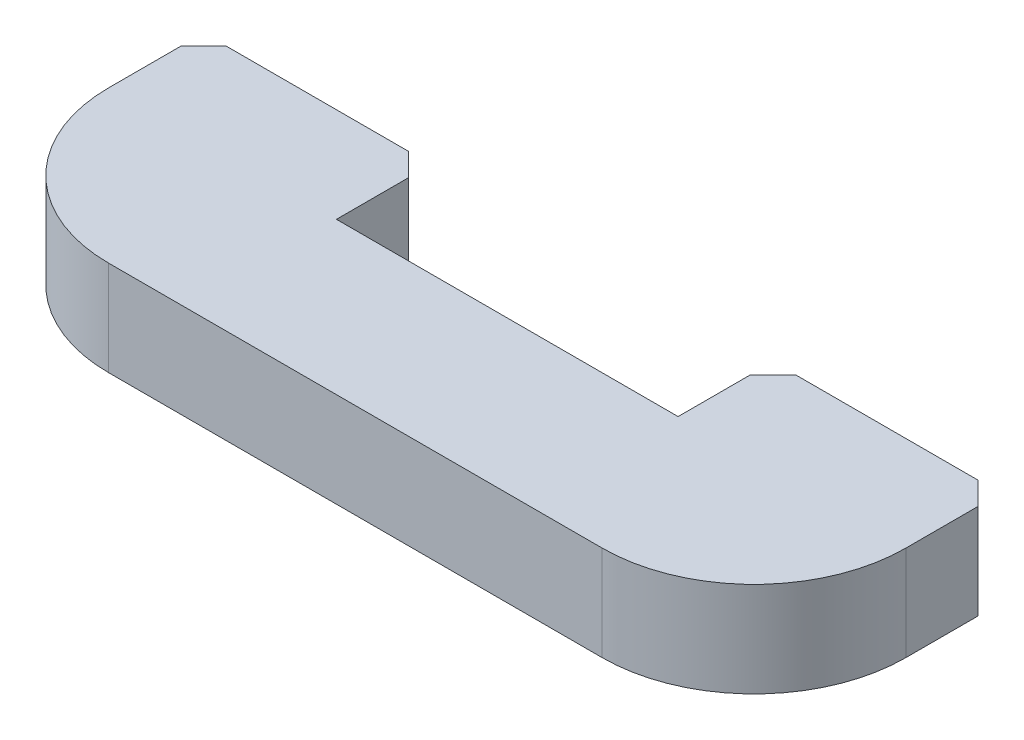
ISO-10303-21;
HEADER;
FILE_DESCRIPTION(('STEP AP214'),'2;1');
FILE_NAME('part.step','',(''),(''),'','','');
FILE_SCHEMA(('AUTOMOTIVE_DESIGN { 1 0 10303 214 1 1 1 1 }'));
ENDSEC;
DATA;
#1=APPLICATION_CONTEXT('core data for automotive mechanical design processes');
#2=APPLICATION_PROTOCOL_DEFINITION('international standard','automotive_design',2000,#1);
#3=PRODUCT_CONTEXT('',#1,'mechanical');
#4=PRODUCT('Part','Part','',(#3));
#5=PRODUCT_RELATED_PRODUCT_CATEGORY('part','',(#4));
#6=PRODUCT_DEFINITION_FORMATION('','',#4);
#7=PRODUCT_DEFINITION_CONTEXT('part definition',#1,'design');
#8=PRODUCT_DEFINITION('design','',#6,#7);
#9=PRODUCT_DEFINITION_SHAPE('','',#8);
#10=(LENGTH_UNIT() NAMED_UNIT(*) SI_UNIT(.MILLI.,.METRE.));
#11=(NAMED_UNIT(*) PLANE_ANGLE_UNIT() SI_UNIT($,.RADIAN.));
#12=(NAMED_UNIT(*) SI_UNIT($,.STERADIAN.) SOLID_ANGLE_UNIT());
#13=UNCERTAINTY_MEASURE_WITH_UNIT(LENGTH_MEASURE(1.E-05),#10,'distance_accuracy_value','');
#14=(GEOMETRIC_REPRESENTATION_CONTEXT(3) GLOBAL_UNCERTAINTY_ASSIGNED_CONTEXT((#13)) GLOBAL_UNIT_ASSIGNED_CONTEXT((#10,
#11,#12)) REPRESENTATION_CONTEXT('',''));
#15=CARTESIAN_POINT('',(0.,0.,0.));
#16=DIRECTION('',(0.,0.,1.));
#17=DIRECTION('',(1.,0.,0.));
#18=AXIS2_PLACEMENT_3D('',#15,#16,#17);
#19=CARTESIAN_POINT('',(-13.335,3.175,-4.1275));
#20=DIRECTION('',(0.,0.,1.));
#21=DIRECTION('',(1.,0.,0.));
#22=AXIS2_PLACEMENT_3D('',#19,#20,#21);
#23=PLANE('',#22);
#24=DIRECTION('',(-1.,0.,0.));
#25=VECTOR('',#24,1.);
#26=CARTESIAN_POINT('',(-13.335,3.175,-4.1275));
#27=LINE('',#26,#25);
#28=CARTESIAN_POINT('',(12.573,3.175,-4.1275));
#29=VERTEX_POINT('',#28);
#30=CARTESIAN_POINT('',(6.477,3.175,-4.1275));
#31=VERTEX_POINT('',#30);
#32=EDGE_CURVE('E197',#29,#31,#27,.T.);
#33=ORIENTED_EDGE('',*,*,#32,.F.);
#34=DIRECTION('',(0.,-1.,0.));
#35=VECTOR('',#34,1.);
#36=CARTESIAN_POINT('',(12.573,3.175,-4.1275));
#37=LINE('',#36,#35);
#38=CARTESIAN_POINT('',(12.573,0.,-4.1275));
#39=VERTEX_POINT('',#38);
#40=EDGE_CURVE('E222',#29,#39,#37,.T.);
#41=ORIENTED_EDGE('',*,*,#40,.T.);
#42=DIRECTION('',(-1.,0.,0.));
#43=VECTOR('',#42,1.);
#44=CARTESIAN_POINT('',(-13.335,0.,-4.1275));
#45=LINE('',#44,#43);
#46=CARTESIAN_POINT('',(6.477,0.,-4.1275));
#47=VERTEX_POINT('',#46);
#48=EDGE_CURVE('E210',#39,#47,#45,.T.);
#49=ORIENTED_EDGE('',*,*,#48,.T.);
#50=DIRECTION('',(0.,1.,0.));
#51=VECTOR('',#50,1.);
#52=CARTESIAN_POINT('',(6.477,3.175,-4.1275));
#53=LINE('',#52,#51);
#54=EDGE_CURVE('E218',#47,#31,#53,.T.);
#55=ORIENTED_EDGE('',*,*,#54,.T.);
#56=EDGE_LOOP('',(#33,#41,#49,#55));
#57=FACE_BOUND('',#56,.T.);
#58=ADVANCED_FACE('F43',(#57),#23,.F.);
#59=CARTESIAN_POINT('',(13.335,3.175,-4.1275));
#60=DIRECTION('',(-1.,0.,0.));
#61=DIRECTION('',(0.,0.,1.));
#62=AXIS2_PLACEMENT_3D('',#59,#60,#61);
#63=PLANE('',#62);
#64=DIRECTION('',(0.,0.,-1.));
#65=VECTOR('',#64,1.);
#66=CARTESIAN_POINT('',(13.335,3.175,-4.1275));
#67=LINE('',#66,#65);
#68=CARTESIAN_POINT('',(13.335,3.175,-0.952500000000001));
#69=VERTEX_POINT('',#68);
#70=CARTESIAN_POINT('',(13.335,3.175,-3.3655));
#71=VERTEX_POINT('',#70);
#72=EDGE_CURVE('E189',#69,#71,#67,.T.);
#73=ORIENTED_EDGE('',*,*,#72,.F.);
#74=DIRECTION('',(0.,-1.,0.));
#75=VECTOR('',#74,1.);
#76=CARTESIAN_POINT('',(13.335,3.175,-0.952500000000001));
#77=LINE('',#76,#75);
#78=CARTESIAN_POINT('',(13.335,0.,-0.952500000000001));
#79=VERTEX_POINT('',#78);
#80=EDGE_CURVE('E271',#69,#79,#77,.T.);
#81=ORIENTED_EDGE('',*,*,#80,.T.);
#82=DIRECTION('',(0.,0.,-1.));
#83=VECTOR('',#82,1.);
#84=CARTESIAN_POINT('',(13.335,0.,-4.1275));
#85=LINE('',#84,#83);
#86=CARTESIAN_POINT('',(13.335,0.,-3.3655));
#87=VERTEX_POINT('',#86);
#88=EDGE_CURVE('E160',#79,#87,#85,.T.);
#89=ORIENTED_EDGE('',*,*,#88,.T.);
#90=DIRECTION('',(0.,1.,0.));
#91=VECTOR('',#90,1.);
#92=CARTESIAN_POINT('',(13.335,3.175,-3.3655));
#93=LINE('',#92,#91);
#94=EDGE_CURVE('E239',#87,#71,#93,.T.);
#95=ORIENTED_EDGE('',*,*,#94,.T.);
#96=EDGE_LOOP('',(#73,#81,#89,#95));
#97=FACE_BOUND('',#96,.T.);
#98=ADVANCED_FACE('F297',(#97),#63,.F.);
#99=CARTESIAN_POINT('',(-6.477,0.,-4.1275));
#100=VERTEX_POINT('',#99);
#101=CARTESIAN_POINT('',(-12.573,0.,-4.1275));
#102=VERTEX_POINT('',#101);
#103=EDGE_CURVE('E206',#100,#102,#45,.T.);
#104=ORIENTED_EDGE('',*,*,#103,.T.);
#105=DIRECTION('',(0.,1.,0.));
#106=VECTOR('',#105,1.);
#107=CARTESIAN_POINT('',(-12.573,3.175,-4.1275));
#108=LINE('',#107,#106);
#109=CARTESIAN_POINT('',(-12.573,3.175,-4.1275));
#110=VERTEX_POINT('',#109);
#111=EDGE_CURVE('E265',#102,#110,#108,.T.);
#112=ORIENTED_EDGE('',*,*,#111,.T.);
#113=CARTESIAN_POINT('',(-6.477,3.175,-4.1275));
#114=VERTEX_POINT('',#113);
#115=EDGE_CURVE('E192',#114,#110,#27,.T.);
#116=ORIENTED_EDGE('',*,*,#115,.F.);
#117=DIRECTION('',(0.,-1.,0.));
#118=VECTOR('',#117,1.);
#119=CARTESIAN_POINT('',(-6.477,3.175,-4.1275));
#120=LINE('',#119,#118);
#121=EDGE_CURVE('E261',#114,#100,#120,.T.);
#122=ORIENTED_EDGE('',*,*,#121,.T.);
#123=EDGE_LOOP('',(#104,#112,#116,#122));
#124=FACE_BOUND('',#123,.T.);
#125=ADVANCED_FACE('F315',(#124),#23,.F.);
#126=CARTESIAN_POINT('',(-13.335,3.175,-4.1275));
#127=DIRECTION('',(1.,0.,0.));
#128=DIRECTION('',(0.,0.,-1.));
#129=AXIS2_PLACEMENT_3D('',#126,#127,#128);
#130=PLANE('',#129);
#131=DIRECTION('',(0.,0.,1.));
#132=VECTOR('',#131,1.);
#133=CARTESIAN_POINT('',(-13.335,0.,-4.1275));
#134=LINE('',#133,#132);
#135=CARTESIAN_POINT('',(-13.335,0.,-3.3655));
#136=VERTEX_POINT('',#135);
#137=CARTESIAN_POINT('',(-13.335,0.,-0.952499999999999));
#138=VERTEX_POINT('',#137);
#139=EDGE_CURVE('E211',#136,#138,#134,.T.);
#140=ORIENTED_EDGE('',*,*,#139,.T.);
#141=DIRECTION('',(0.,-1.,0.));
#142=VECTOR('',#141,1.);
#143=CARTESIAN_POINT('',(-13.335,3.175,-0.952499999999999));
#144=LINE('',#143,#142);
#145=CARTESIAN_POINT('',(-13.335,3.175,-0.952499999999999));
#146=VERTEX_POINT('',#145);
#147=EDGE_CURVE('E11',#138,#146,#144,.F.);
#148=ORIENTED_EDGE('',*,*,#147,.T.);
#149=DIRECTION('',(0.,0.,1.));
#150=VECTOR('',#149,1.);
#151=CARTESIAN_POINT('',(-13.335,3.175,-4.1275));
#152=LINE('',#151,#150);
#153=CARTESIAN_POINT('',(-13.335,3.175,-3.3655));
#154=VERTEX_POINT('',#153);
#155=EDGE_CURVE('E198',#154,#146,#152,.T.);
#156=ORIENTED_EDGE('',*,*,#155,.F.);
#157=DIRECTION('',(0.,-1.,0.));
#158=VECTOR('',#157,1.);
#159=CARTESIAN_POINT('',(-13.335,3.175,-3.3655));
#160=LINE('',#159,#158);
#161=EDGE_CURVE('E257',#154,#136,#160,.T.);
#162=ORIENTED_EDGE('',*,*,#161,.T.);
#163=EDGE_LOOP('',(#140,#148,#156,#162));
#164=FACE_BOUND('',#163,.T.);
#165=ADVANCED_FACE('F307',(#164),#130,.F.);
#166=CARTESIAN_POINT('',(-13.335,3.175,4.1275));
#167=DIRECTION('',(0.,0.,-1.));
#168=DIRECTION('',(-1.,0.,0.));
#169=AXIS2_PLACEMENT_3D('',#166,#167,#168);
#170=PLANE('',#169);
#171=DIRECTION('',(1.,0.,0.));
#172=VECTOR('',#171,1.);
#173=CARTESIAN_POINT('',(-13.335,0.,4.1275));
#174=LINE('',#173,#172);
#175=CARTESIAN_POINT('',(-8.255,0.,4.1275));
#176=VERTEX_POINT('',#175);
#177=CARTESIAN_POINT('',(8.255,0.,4.1275));
#178=VERTEX_POINT('',#177);
#179=EDGE_CURVE('E193',#176,#178,#174,.T.);
#180=ORIENTED_EDGE('',*,*,#179,.T.);
#181=DIRECTION('',(0.,-1.,0.));
#182=VECTOR('',#181,1.);
#183=CARTESIAN_POINT('',(8.255,3.175,4.1275));
#184=LINE('',#183,#182);
#185=CARTESIAN_POINT('',(8.255,3.175,4.1275));
#186=VERTEX_POINT('',#185);
#187=EDGE_CURVE('E65',#178,#186,#184,.F.);
#188=ORIENTED_EDGE('',*,*,#187,.T.);
#189=DIRECTION('',(1.,0.,0.));
#190=VECTOR('',#189,1.);
#191=CARTESIAN_POINT('',(-13.335,3.175,4.1275));
#192=LINE('',#191,#190);
#193=CARTESIAN_POINT('',(-8.255,3.175,4.1275));
#194=VERTEX_POINT('',#193);
#195=EDGE_CURVE('E201',#194,#186,#192,.T.);
#196=ORIENTED_EDGE('',*,*,#195,.F.);
#197=DIRECTION('',(0.,-1.,0.));
#198=VECTOR('',#197,1.);
#199=CARTESIAN_POINT('',(-8.255,3.175,4.1275));
#200=LINE('',#199,#198);
#201=EDGE_CURVE('E281',#194,#176,#200,.T.);
#202=ORIENTED_EDGE('',*,*,#201,.T.);
#203=EDGE_LOOP('',(#180,#188,#196,#202));
#204=FACE_BOUND('',#203,.T.);
#205=ADVANCED_FACE('F302',(#204),#170,.F.);
#206=CARTESIAN_POINT('',(0.,3.175,0.));
#207=DIRECTION('',(0.,1.,0.));
#208=DIRECTION('',(0.,0.,1.));
#209=AXIS2_PLACEMENT_3D('',#206,#207,#208);
#210=PLANE('',#209);
#211=ORIENTED_EDGE('',*,*,#195,.T.);
#212=CARTESIAN_POINT('',(8.255,3.175,-0.9525));
#213=DIRECTION('',(0.,1.,0.));
#214=DIRECTION('',(0.,0.,1.));
#215=AXIS2_PLACEMENT_3D('',#212,#213,#214);
#216=CIRCLE('',#215,5.08);
#217=EDGE_CURVE('E52',#186,#69,#216,.T.);
#218=ORIENTED_EDGE('',*,*,#217,.T.);
#219=ORIENTED_EDGE('',*,*,#72,.T.);
#220=DIRECTION('',(0.707106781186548,0.,0.707106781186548));
#221=VECTOR('',#220,1.);
#222=CARTESIAN_POINT('',(8.35025,3.175,-8.35025));
#223=LINE('',#222,#221);
#224=EDGE_CURVE('E252',#71,#29,#223,.F.);
#225=ORIENTED_EDGE('',*,*,#224,.T.);
#226=ORIENTED_EDGE('',*,*,#32,.T.);
#227=DIRECTION('',(0.707106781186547,0.,-0.707106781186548));
#228=VECTOR('',#227,1.);
#229=CARTESIAN_POINT('',(1.17475000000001,3.175,1.17475));
#230=LINE('',#229,#228);
#231=CARTESIAN_POINT('',(5.715,3.175,-3.3655));
#232=VERTEX_POINT('',#231);
#233=EDGE_CURVE('E249',#31,#232,#230,.F.);
#234=ORIENTED_EDGE('',*,*,#233,.T.);
#235=DIRECTION('',(0.,0.,-1.));
#236=VECTOR('',#235,1.);
#237=CARTESIAN_POINT('',(5.715,3.175,-7.3025));
#238=LINE('',#237,#236);
#239=CARTESIAN_POINT('',(5.715,3.175,-0.952500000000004));
#240=VERTEX_POINT('',#239);
#241=EDGE_CURVE('E181',#240,#232,#238,.T.);
#242=ORIENTED_EDGE('',*,*,#241,.F.);
#243=DIRECTION('',(1.,0.,0.));
#244=VECTOR('',#243,1.);
#245=CARTESIAN_POINT('',(-5.715,3.175,-0.952500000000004));
#246=LINE('',#245,#244);
#247=CARTESIAN_POINT('',(-5.715,3.175,-0.952500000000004));
#248=VERTEX_POINT('',#247);
#249=EDGE_CURVE('E155',#248,#240,#246,.T.);
#250=ORIENTED_EDGE('',*,*,#249,.F.);
#251=DIRECTION('',(0.,0.,1.));
#252=VECTOR('',#251,1.);
#253=CARTESIAN_POINT('',(-5.715,3.175,-7.3025));
#254=LINE('',#253,#252);
#255=CARTESIAN_POINT('',(-5.715,3.175,-3.3655));
#256=VERTEX_POINT('',#255);
#257=EDGE_CURVE('E184',#256,#248,#254,.T.);
#258=ORIENTED_EDGE('',*,*,#257,.F.);
#259=DIRECTION('',(0.707106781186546,0.,0.70710678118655));
#260=VECTOR('',#259,1.);
#261=CARTESIAN_POINT('',(-1.17475000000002,3.175,1.17475000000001));
#262=LINE('',#261,#260);
#263=EDGE_CURVE('E243',#256,#114,#262,.F.);
#264=ORIENTED_EDGE('',*,*,#263,.T.);
#265=ORIENTED_EDGE('',*,*,#115,.T.);
#266=DIRECTION('',(0.707106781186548,0.,-0.707106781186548));
#267=VECTOR('',#266,1.);
#268=CARTESIAN_POINT('',(-8.35025,3.175,-8.35025));
#269=LINE('',#268,#267);
#270=EDGE_CURVE('E246',#110,#154,#269,.F.);
#271=ORIENTED_EDGE('',*,*,#270,.T.);
#272=ORIENTED_EDGE('',*,*,#155,.T.);
#273=CARTESIAN_POINT('',(-8.255,3.175,-0.9525));
#274=DIRECTION('',(0.,1.,0.));
#275=DIRECTION('',(0.,0.,1.));
#276=AXIS2_PLACEMENT_3D('',#273,#274,#275);
#277=CIRCLE('',#276,5.08);
#278=EDGE_CURVE('E287',#146,#194,#277,.T.);
#279=ORIENTED_EDGE('',*,*,#278,.T.);
#280=EDGE_LOOP('',(#211,#218,#219,#225,#226,#234,#242,#250,#258,#264,#265,#271,#272,#279));
#281=FACE_BOUND('',#280,.T.);
#282=ADVANCED_FACE('F293',(#281),#210,.T.);
#283=CARTESIAN_POINT('',(0.,0.,0.));
#284=DIRECTION('',(0.,1.,0.));
#285=DIRECTION('',(0.,0.,1.));
#286=AXIS2_PLACEMENT_3D('',#283,#284,#285);
#287=PLANE('',#286);
#288=ORIENTED_EDGE('',*,*,#88,.F.);
#289=CARTESIAN_POINT('',(8.255,0.,-0.9525));
#290=DIRECTION('',(0.,1.,0.));
#291=DIRECTION('',(0.,0.,1.));
#292=AXIS2_PLACEMENT_3D('',#289,#290,#291);
#293=CIRCLE('',#292,5.08);
#294=EDGE_CURVE('E278',#79,#178,#293,.F.);
#295=ORIENTED_EDGE('',*,*,#294,.T.);
#296=ORIENTED_EDGE('',*,*,#179,.F.);
#297=CARTESIAN_POINT('',(-8.255,0.,-0.9525));
#298=DIRECTION('',(0.,1.,0.));
#299=DIRECTION('',(0.,0.,1.));
#300=AXIS2_PLACEMENT_3D('',#297,#298,#299);
#301=CIRCLE('',#300,5.08);
#302=EDGE_CURVE('E275',#176,#138,#301,.F.);
#303=ORIENTED_EDGE('',*,*,#302,.T.);
#304=ORIENTED_EDGE('',*,*,#139,.F.);
#305=DIRECTION('',(-0.707106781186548,0.,0.707106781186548));
#306=VECTOR('',#305,1.);
#307=CARTESIAN_POINT('',(-13.335,0.,-3.3655));
#308=LINE('',#307,#306);
#309=EDGE_CURVE('E229',#136,#102,#308,.F.);
#310=ORIENTED_EDGE('',*,*,#309,.T.);
#311=ORIENTED_EDGE('',*,*,#103,.F.);
#312=DIRECTION('',(-0.707106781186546,0.,-0.70710678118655));
#313=VECTOR('',#312,1.);
#314=CARTESIAN_POINT('',(-6.477,0.,-4.1275));
#315=LINE('',#314,#313);
#316=CARTESIAN_POINT('',(-5.715,0.,-3.3655));
#317=VERTEX_POINT('',#316);
#318=EDGE_CURVE('E226',#100,#317,#315,.F.);
#319=ORIENTED_EDGE('',*,*,#318,.T.);
#320=DIRECTION('',(0.,0.,1.));
#321=VECTOR('',#320,1.);
#322=CARTESIAN_POINT('',(-5.715,0.,0.));
#323=LINE('',#322,#321);
#324=CARTESIAN_POINT('',(-5.715,0.,-0.952500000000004));
#325=VERTEX_POINT('',#324);
#326=EDGE_CURVE('E175',#317,#325,#323,.T.);
#327=ORIENTED_EDGE('',*,*,#326,.T.);
#328=DIRECTION('',(1.,0.,0.));
#329=VECTOR('',#328,1.);
#330=CARTESIAN_POINT('',(-5.715,0.,-0.952500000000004));
#331=LINE('',#330,#329);
#332=CARTESIAN_POINT('',(5.715,0.,-0.952500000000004));
#333=VERTEX_POINT('',#332);
#334=EDGE_CURVE('E152',#325,#333,#331,.T.);
#335=ORIENTED_EDGE('',*,*,#334,.T.);
#336=DIRECTION('',(0.,0.,-1.));
#337=VECTOR('',#336,1.);
#338=CARTESIAN_POINT('',(5.715,0.,-7.3025));
#339=LINE('',#338,#337);
#340=CARTESIAN_POINT('',(5.715,0.,-3.3655));
#341=VERTEX_POINT('',#340);
#342=EDGE_CURVE('E164',#333,#341,#339,.T.);
#343=ORIENTED_EDGE('',*,*,#342,.T.);
#344=DIRECTION('',(-0.707106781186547,0.,0.707106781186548));
#345=VECTOR('',#344,1.);
#346=CARTESIAN_POINT('',(6.477,0.,-4.1275));
#347=LINE('',#346,#345);
#348=EDGE_CURVE('E232',#341,#47,#347,.F.);
#349=ORIENTED_EDGE('',*,*,#348,.T.);
#350=ORIENTED_EDGE('',*,*,#48,.F.);
#351=DIRECTION('',(-0.707106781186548,0.,-0.707106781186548));
#352=VECTOR('',#351,1.);
#353=CARTESIAN_POINT('',(12.573,0.,-4.1275));
#354=LINE('',#353,#352);
#355=EDGE_CURVE('E235',#39,#87,#354,.F.);
#356=ORIENTED_EDGE('',*,*,#355,.T.);
#357=EDGE_LOOP('',(#288,#295,#296,#303,#304,#310,#311,#319,#327,#335,#343,#349,#350,#356));
#358=FACE_BOUND('',#357,.T.);
#359=ADVANCED_FACE('F173',(#358),#287,.F.);
#360=CARTESIAN_POINT('',(5.715,0.,-7.3025));
#361=DIRECTION('',(1.,0.,0.));
#362=DIRECTION('',(0.,0.,-1.));
#363=AXIS2_PLACEMENT_3D('',#360,#361,#362);
#364=PLANE('',#363);
#365=ORIENTED_EDGE('',*,*,#241,.T.);
#366=DIRECTION('',(0.,-1.,0.));
#367=VECTOR('',#366,1.);
#368=CARTESIAN_POINT('',(5.715,0.,-3.3655));
#369=LINE('',#368,#367);
#370=EDGE_CURVE('E167',#232,#341,#369,.T.);
#371=ORIENTED_EDGE('',*,*,#370,.T.);
#372=ORIENTED_EDGE('',*,*,#342,.F.);
#373=DIRECTION('',(0.,1.,0.));
#374=VECTOR('',#373,1.);
#375=CARTESIAN_POINT('',(5.715,0.,-0.952500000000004));
#376=LINE('',#375,#374);
#377=EDGE_CURVE('E147',#333,#240,#376,.T.);
#378=ORIENTED_EDGE('',*,*,#377,.T.);
#379=EDGE_LOOP('',(#365,#371,#372,#378));
#380=FACE_BOUND('',#379,.T.);
#381=ADVANCED_FACE('F165',(#380),#364,.F.);
#382=CARTESIAN_POINT('',(-5.715,0.,-7.3025));
#383=DIRECTION('',(-1.,0.,0.));
#384=DIRECTION('',(0.,0.,1.));
#385=AXIS2_PLACEMENT_3D('',#382,#383,#384);
#386=PLANE('',#385);
#387=ORIENTED_EDGE('',*,*,#326,.F.);
#388=DIRECTION('',(0.,1.,0.));
#389=VECTOR('',#388,1.);
#390=CARTESIAN_POINT('',(-5.715,0.,-3.3655));
#391=LINE('',#390,#389);
#392=EDGE_CURVE('E268',#317,#256,#391,.T.);
#393=ORIENTED_EDGE('',*,*,#392,.T.);
#394=ORIENTED_EDGE('',*,*,#257,.T.);
#395=DIRECTION('',(0.,1.,0.));
#396=VECTOR('',#395,1.);
#397=CARTESIAN_POINT('',(-5.715,0.,-0.952500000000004));
#398=LINE('',#397,#396);
#399=EDGE_CURVE('E161',#325,#248,#398,.T.);
#400=ORIENTED_EDGE('',*,*,#399,.F.);
#401=EDGE_LOOP('',(#387,#393,#394,#400));
#402=FACE_BOUND('',#401,.T.);
#403=ADVANCED_FACE('F323',(#402),#386,.F.);
#404=CARTESIAN_POINT('',(-5.715,0.,-0.952500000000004));
#405=DIRECTION('',(0.,0.,1.));
#406=DIRECTION('',(1.,0.,0.));
#407=AXIS2_PLACEMENT_3D('',#404,#405,#406);
#408=PLANE('',#407);
#409=ORIENTED_EDGE('',*,*,#249,.T.);
#410=ORIENTED_EDGE('',*,*,#377,.F.);
#411=ORIENTED_EDGE('',*,*,#334,.F.);
#412=ORIENTED_EDGE('',*,*,#399,.T.);
#413=EDGE_LOOP('',(#409,#410,#411,#412));
#414=FACE_BOUND('',#413,.T.);
#415=ADVANCED_FACE('F149',(#414),#408,.F.);
#416=CARTESIAN_POINT('',(12.573,3.175,-4.1275));
#417=DIRECTION('',(-0.707106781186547,0.,0.707106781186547));
#418=DIRECTION('',(0.,-1.,0.));
#419=AXIS2_PLACEMENT_3D('',#416,#417,#418);
#420=PLANE('',#419);
#421=ORIENTED_EDGE('',*,*,#224,.F.);
#422=ORIENTED_EDGE('',*,*,#94,.F.);
#423=ORIENTED_EDGE('',*,*,#355,.F.);
#424=ORIENTED_EDGE('',*,*,#40,.F.);
#425=EDGE_LOOP('',(#421,#422,#423,#424));
#426=FACE_BOUND('',#425,.T.);
#427=ADVANCED_FACE('F337',(#426),#420,.F.);
#428=CARTESIAN_POINT('',(6.477,3.175,-4.1275));
#429=DIRECTION('',(0.707106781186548,0.,0.707106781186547));
#430=DIRECTION('',(0.,1.,0.));
#431=AXIS2_PLACEMENT_3D('',#428,#429,#430);
#432=PLANE('',#431);
#433=ORIENTED_EDGE('',*,*,#348,.F.);
#434=ORIENTED_EDGE('',*,*,#370,.F.);
#435=ORIENTED_EDGE('',*,*,#233,.F.);
#436=ORIENTED_EDGE('',*,*,#54,.F.);
#437=EDGE_LOOP('',(#433,#434,#435,#436));
#438=FACE_BOUND('',#437,.T.);
#439=ADVANCED_FACE('F327',(#438),#432,.F.);
#440=CARTESIAN_POINT('',(-13.335,3.175,-3.3655));
#441=DIRECTION('',(0.707106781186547,0.,0.707106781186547));
#442=DIRECTION('',(0.,-1.,0.));
#443=AXIS2_PLACEMENT_3D('',#440,#441,#442);
#444=PLANE('',#443);
#445=ORIENTED_EDGE('',*,*,#270,.F.);
#446=ORIENTED_EDGE('',*,*,#111,.F.);
#447=ORIENTED_EDGE('',*,*,#309,.F.);
#448=ORIENTED_EDGE('',*,*,#161,.F.);
#449=EDGE_LOOP('',(#445,#446,#447,#448));
#450=FACE_BOUND('',#449,.T.);
#451=ADVANCED_FACE('F311',(#450),#444,.F.);
#452=CARTESIAN_POINT('',(-6.477,3.175,-4.1275));
#453=DIRECTION('',(-0.707106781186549,0.,0.707106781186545));
#454=DIRECTION('',(0.,-1.,0.));
#455=AXIS2_PLACEMENT_3D('',#452,#453,#454);
#456=PLANE('',#455);
#457=ORIENTED_EDGE('',*,*,#263,.F.);
#458=ORIENTED_EDGE('',*,*,#392,.F.);
#459=ORIENTED_EDGE('',*,*,#318,.F.);
#460=ORIENTED_EDGE('',*,*,#121,.F.);
#461=EDGE_LOOP('',(#457,#458,#459,#460));
#462=FACE_BOUND('',#461,.T.);
#463=ADVANCED_FACE('F320',(#462),#456,.F.);
#464=CARTESIAN_POINT('',(8.255,3.175,-0.9525));
#465=DIRECTION('',(0.,-1.,0.));
#466=DIRECTION('',(0.,0.,-1.));
#467=AXIS2_PLACEMENT_3D('',#464,#465,#466);
#468=CYLINDRICAL_SURFACE('',#467,5.08);
#469=ORIENTED_EDGE('',*,*,#217,.F.);
#470=ORIENTED_EDGE('',*,*,#187,.F.);
#471=ORIENTED_EDGE('',*,*,#294,.F.);
#472=ORIENTED_EDGE('',*,*,#80,.F.);
#473=EDGE_LOOP('',(#469,#470,#471,#472));
#474=FACE_BOUND('',#473,.T.);
#475=ADVANCED_FACE('F300',(#474),#468,.T.);
#476=CARTESIAN_POINT('',(-8.255,3.175,-0.9525));
#477=DIRECTION('',(0.,-1.,0.));
#478=DIRECTION('',(0.,0.,-1.));
#479=AXIS2_PLACEMENT_3D('',#476,#477,#478);
#480=CYLINDRICAL_SURFACE('',#479,5.08);
#481=ORIENTED_EDGE('',*,*,#278,.F.);
#482=ORIENTED_EDGE('',*,*,#147,.F.);
#483=ORIENTED_EDGE('',*,*,#302,.F.);
#484=ORIENTED_EDGE('',*,*,#201,.F.);
#485=EDGE_LOOP('',(#481,#482,#483,#484));
#486=FACE_BOUND('',#485,.T.);
#487=ADVANCED_FACE('F45',(#486),#480,.T.);
#488=CLOSED_SHELL('',(#58,#98,#125,#165,#205,#282,#359,#381,#403,#415,#427,#439,#451,#463,#475,#487));
#489=MANIFOLD_SOLID_BREP('B2',#488);
#490=ADVANCED_BREP_SHAPE_REPRESENTATION('',(#18,#489),#14);
#491=SHAPE_DEFINITION_REPRESENTATION(#9,#490);
ENDSEC;
END-ISO-10303-21;
